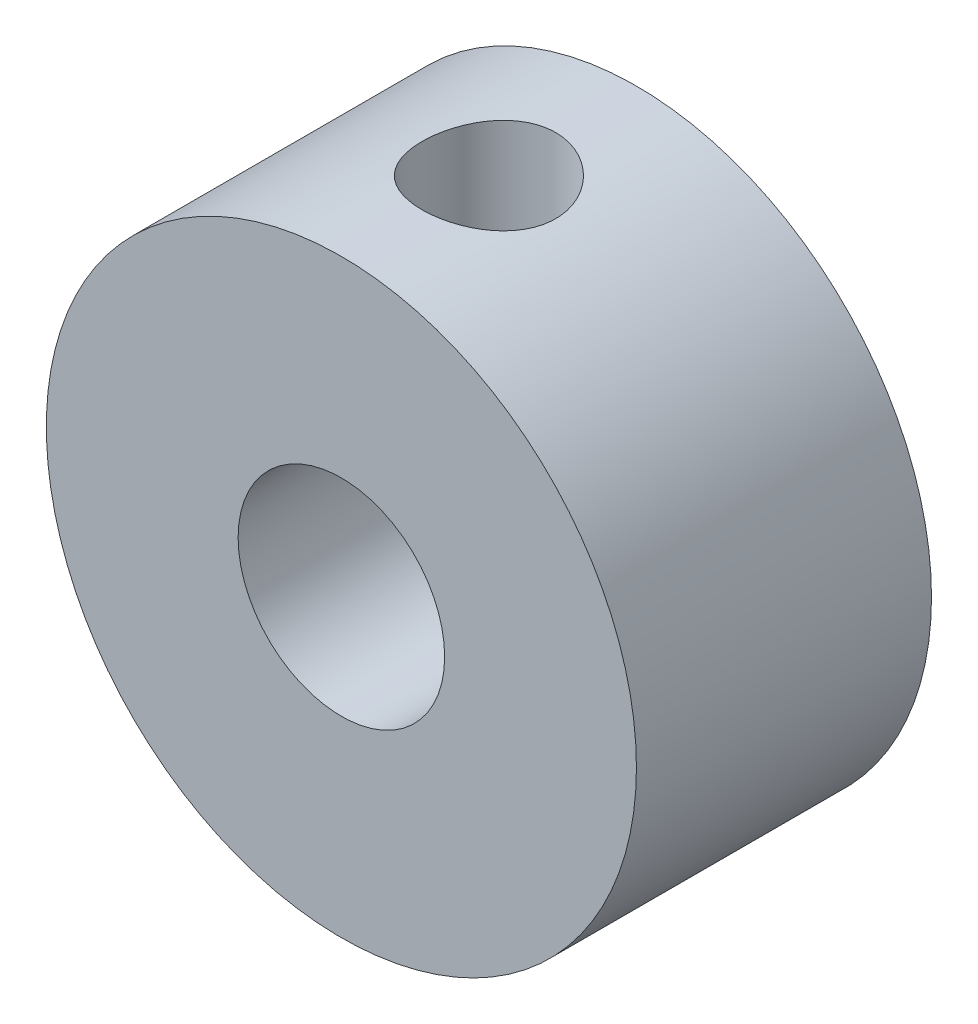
ISO-10303-21;
HEADER;
FILE_DESCRIPTION(('STEP AP214'),'2;1');
FILE_NAME('part.step','',(''),(''),'','','');
FILE_SCHEMA(('AUTOMOTIVE_DESIGN { 1 0 10303 214 1 1 1 1 }'));
ENDSEC;
DATA;
#1=APPLICATION_CONTEXT('core data for automotive mechanical design processes');
#2=APPLICATION_PROTOCOL_DEFINITION('international standard','automotive_design',2000,#1);
#3=PRODUCT_CONTEXT('',#1,'mechanical');
#4=PRODUCT('Part','Part','',(#3));
#5=PRODUCT_RELATED_PRODUCT_CATEGORY('part','',(#4));
#6=PRODUCT_DEFINITION_FORMATION('','',#4);
#7=PRODUCT_DEFINITION_CONTEXT('part definition',#1,'design');
#8=PRODUCT_DEFINITION('design','',#6,#7);
#9=PRODUCT_DEFINITION_SHAPE('','',#8);
#10=(LENGTH_UNIT() NAMED_UNIT(*) SI_UNIT(.MILLI.,.METRE.));
#11=(NAMED_UNIT(*) PLANE_ANGLE_UNIT() SI_UNIT($,.RADIAN.));
#12=(NAMED_UNIT(*) SI_UNIT($,.STERADIAN.) SOLID_ANGLE_UNIT());
#13=UNCERTAINTY_MEASURE_WITH_UNIT(LENGTH_MEASURE(1.E-05),#10,'distance_accuracy_value','');
#14=(GEOMETRIC_REPRESENTATION_CONTEXT(3) GLOBAL_UNCERTAINTY_ASSIGNED_CONTEXT((#13)) GLOBAL_UNIT_ASSIGNED_CONTEXT((#10,
#11,#12)) REPRESENTATION_CONTEXT('',''));
#15=CARTESIAN_POINT('',(0.,0.,0.));
#16=DIRECTION('',(0.,0.,1.));
#17=DIRECTION('',(1.,0.,0.));
#18=AXIS2_PLACEMENT_3D('',#15,#16,#17);
#19=CARTESIAN_POINT('',(0.,0.,7.49999999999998));
#20=DIRECTION('',(0.,0.,0.999999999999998));
#21=DIRECTION('',(1.,0.,0.));
#22=AXIS2_PLACEMENT_3D('',#19,#20,#21);
#23=PLANE('',#22);
#24=CARTESIAN_POINT('',(0.,0.,7.49999999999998));
#25=DIRECTION('',(0.,0.,0.999999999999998));
#26=DIRECTION('',(1.,0.,0.));
#27=AXIS2_PLACEMENT_3D('',#24,#25,#26);
#28=CIRCLE('',#27,15.);
#29=CARTESIAN_POINT('',(15.,0.,7.49999999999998));
#30=VERTEX_POINT('',#29);
#31=EDGE_CURVE('E13',#30,#30,#28,.T.);
#32=ORIENTED_EDGE('',*,*,#31,.T.);
#33=EDGE_LOOP('',(#32));
#34=FACE_BOUND('',#33,.T.);
#35=CARTESIAN_POINT('',(0.,0.,7.49999999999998));
#36=DIRECTION('',(0.,0.,0.999999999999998));
#37=DIRECTION('',(1.,0.,0.));
#38=AXIS2_PLACEMENT_3D('',#35,#36,#37);
#39=CIRCLE('',#38,5.25);
#40=CARTESIAN_POINT('',(5.25,0.,7.49999999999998));
#41=VERTEX_POINT('',#40);
#42=EDGE_CURVE('E78',#41,#41,#39,.T.);
#43=ORIENTED_EDGE('',*,*,#42,.F.);
#44=EDGE_LOOP('',(#43));
#45=FACE_BOUND('',#44,.T.);
#46=ADVANCED_FACE('F48',(#34,#45),#23,.T.);
#47=CARTESIAN_POINT('',(0.,0.,-7.49999999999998));
#48=DIRECTION('',(0.,0.,0.999999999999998));
#49=DIRECTION('',(1.,0.,0.));
#50=AXIS2_PLACEMENT_3D('',#47,#48,#49);
#51=PLANE('',#50);
#52=CARTESIAN_POINT('',(0.,0.,-7.49999999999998));
#53=DIRECTION('',(0.,0.,0.999999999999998));
#54=DIRECTION('',(1.,0.,0.));
#55=AXIS2_PLACEMENT_3D('',#52,#53,#54);
#56=CIRCLE('',#55,15.);
#57=CARTESIAN_POINT('',(15.,0.,-7.49999999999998));
#58=VERTEX_POINT('',#57);
#59=EDGE_CURVE('E62',#58,#58,#56,.T.);
#60=ORIENTED_EDGE('',*,*,#59,.F.);
#61=EDGE_LOOP('',(#60));
#62=FACE_BOUND('',#61,.T.);
#63=CARTESIAN_POINT('',(0.,0.,-7.49999999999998));
#64=DIRECTION('',(0.,0.,0.999999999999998));
#65=DIRECTION('',(1.,0.,0.));
#66=AXIS2_PLACEMENT_3D('',#63,#64,#65);
#67=CIRCLE('',#66,5.25);
#68=CARTESIAN_POINT('',(5.25,0.,-7.49999999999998));
#69=VERTEX_POINT('',#68);
#70=EDGE_CURVE('E76',#69,#69,#67,.T.);
#71=ORIENTED_EDGE('',*,*,#70,.T.);
#72=EDGE_LOOP('',(#71));
#73=FACE_BOUND('',#72,.T.);
#74=ADVANCED_FACE('F93',(#62,#73),#51,.F.);
#75=CARTESIAN_POINT('',(0.,0.,7.49999999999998));
#76=DIRECTION('',(0.,0.,-0.999999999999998));
#77=DIRECTION('',(-1.,0.,0.));
#78=AXIS2_PLACEMENT_3D('',#75,#76,#77);
#79=CYLINDRICAL_SURFACE('',#78,15.);
#80=CARTESIAN_POINT('',(0.,15.,3.39999999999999));
#81=CARTESIAN_POINT('',(-0.188398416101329,14.9999965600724,3.39999381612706));
#82=CARTESIAN_POINT('',(-0.37687010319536,14.9964147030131,3.38428806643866));
#83=CARTESIAN_POINT('',(-0.748448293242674,14.9824721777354,3.32195220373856));
#84=CARTESIAN_POINT('',(-0.931551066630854,14.9721069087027,3.27530110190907));
#85=CARTESIAN_POINT('',(-1.28696868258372,14.9457501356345,3.1526200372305));
#86=CARTESIAN_POINT('',(-1.45929497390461,14.9297647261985,3.07662189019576));
#87=CARTESIAN_POINT('',(-1.78874674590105,14.8938873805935,2.8975077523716));
#88=CARTESIAN_POINT('',(-1.94587239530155,14.8739954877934,2.79439206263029));
#89=CARTESIAN_POINT('',(-2.24316295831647,14.8320979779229,2.5620984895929));
#90=CARTESIAN_POINT('',(-2.38302976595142,14.8100645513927,2.43254407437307));
#91=CARTESIAN_POINT('',(-2.6392459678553,14.7665604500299,2.1518584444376));
#92=CARTESIAN_POINT('',(-2.75559313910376,14.745089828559,2.00072519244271));
#93=CARTESIAN_POINT('',(-2.96280355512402,14.7048667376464,1.67894112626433));
#94=CARTESIAN_POINT('',(-3.05334554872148,14.6861498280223,1.50807860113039));
#95=CARTESIAN_POINT('',(-3.2043135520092,14.6539541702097,1.15306825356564));
#96=CARTESIAN_POINT('',(-3.26474345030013,14.6404747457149,0.968922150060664));
#97=CARTESIAN_POINT('',(-3.35277893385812,14.6205641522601,0.595816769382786));
#98=CARTESIAN_POINT('',(-3.38091436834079,14.6140193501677,0.406988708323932));
#99=CARTESIAN_POINT('',(-3.40521049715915,14.6083780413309,0.0271878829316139));
#100=CARTESIAN_POINT('',(-3.40137542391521,14.6092805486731,-0.163784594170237));
#101=CARTESIAN_POINT('',(-3.36226490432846,14.6183291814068,-0.538485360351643));
#102=CARTESIAN_POINT('',(-3.32760872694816,14.6263326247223,-0.722282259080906));
#103=CARTESIAN_POINT('',(-3.22882250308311,14.6484553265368,-1.08138332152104));
#104=CARTESIAN_POINT('',(-3.16469069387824,14.6625749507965,-1.25668697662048));
#105=CARTESIAN_POINT('',(-3.00821508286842,14.6954773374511,-1.59554668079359));
#106=CARTESIAN_POINT('',(-2.9156364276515,14.7142986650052,-1.75899038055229));
#107=CARTESIAN_POINT('',(-2.70505999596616,14.7544605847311,-2.06825036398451));
#108=CARTESIAN_POINT('',(-2.58705851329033,14.7758015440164,-2.21406407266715));
#109=CARTESIAN_POINT('',(-2.32572493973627,14.819207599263,-2.48748645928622));
#110=CARTESIAN_POINT('',(-2.1818671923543,14.8412779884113,-2.61459241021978));
#111=CARTESIAN_POINT('',(-1.87462374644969,14.883204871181,-2.84296027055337));
#112=CARTESIAN_POINT('',(-1.71123764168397,14.9030613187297,-2.94422164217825));
#113=CARTESIAN_POINT('',(-1.36893681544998,14.938395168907,-3.11816447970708));
#114=CARTESIAN_POINT('',(-1.18998551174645,14.9538618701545,-3.19077626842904));
#115=CARTESIAN_POINT('',(-0.821991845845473,14.9785945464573,-3.30475659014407));
#116=CARTESIAN_POINT('',(-0.632951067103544,14.9878614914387,-3.34613001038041));
#117=CARTESIAN_POINT('',(-0.254453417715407,14.9990111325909,-3.39571913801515));
#118=CARTESIAN_POINT('',(-0.0650908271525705,15.0010466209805,-3.40462104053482));
#119=CARTESIAN_POINT('',(0.312416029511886,14.9979338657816,-3.3908796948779));
#120=CARTESIAN_POINT('',(0.500560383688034,14.9927861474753,-3.36823875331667));
#121=CARTESIAN_POINT('',(0.867989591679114,14.9759821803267,-3.29262273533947));
#122=CARTESIAN_POINT('',(1.04735312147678,14.9644039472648,-3.24001107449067));
#123=CARTESIAN_POINT('',(1.39470739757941,14.9360365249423,-3.10635327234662));
#124=CARTESIAN_POINT('',(1.56269712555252,14.9192468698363,-3.02530458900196));
#125=CARTESIAN_POINT('',(1.88534686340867,14.8819443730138,-2.83566807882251));
#126=CARTESIAN_POINT('',(2.03976639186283,14.8613789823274,-2.72668166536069));
#127=CARTESIAN_POINT('',(2.32837060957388,14.818907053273,-2.48478445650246));
#128=CARTESIAN_POINT('',(2.46255245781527,14.7970003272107,-2.35187030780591));
#129=CARTESIAN_POINT('',(2.7096136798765,14.7537814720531,-2.06273173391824));
#130=CARTESIAN_POINT('',(2.82201624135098,14.7324898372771,-1.90609623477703));
#131=CARTESIAN_POINT('',(3.0189258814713,14.6934068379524,-1.57577037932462));
#132=CARTESIAN_POINT('',(3.10343419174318,14.6756153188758,-1.40208077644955));
#133=CARTESIAN_POINT('',(3.24156644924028,14.645724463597,-1.04352103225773));
#134=CARTESIAN_POINT('',(3.29536818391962,14.6335924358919,-0.858722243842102));
#135=CARTESIAN_POINT('',(3.37107068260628,14.6163407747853,-0.4823940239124));
#136=CARTESIAN_POINT('',(3.39297698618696,14.6112199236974,-0.290865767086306));
#137=CARTESIAN_POINT('',(3.40401761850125,14.6086511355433,0.0886670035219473));
#138=CARTESIAN_POINT('',(3.39390928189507,14.6110258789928,0.276648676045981));
#139=CARTESIAN_POINT('',(3.34291038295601,14.6227775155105,0.648154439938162));
#140=CARTESIAN_POINT('',(3.30202024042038,14.632154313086,0.83167859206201));
#141=CARTESIAN_POINT('',(3.19099639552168,14.656763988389,1.18840444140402));
#142=CARTESIAN_POINT('',(3.12098065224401,14.6719732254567,1.36164459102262));
#143=CARTESIAN_POINT('',(2.95379168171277,14.706541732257,1.69402899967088));
#144=CARTESIAN_POINT('',(2.85661538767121,14.7259014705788,1.85317166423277));
#145=CARTESIAN_POINT('',(2.63538535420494,14.7671135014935,2.1565594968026));
#146=CARTESIAN_POINT('',(2.51079524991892,14.7890106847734,2.30040752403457));
#147=CARTESIAN_POINT('',(2.23935138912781,14.8325373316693,2.56540247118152));
#148=CARTESIAN_POINT('',(2.09249246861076,14.8541667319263,2.68654411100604));
#149=CARTESIAN_POINT('',(1.77817220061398,14.895084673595,2.90433795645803));
#150=CARTESIAN_POINT('',(1.61044858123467,14.9143357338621,3.00061912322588));
#151=CARTESIAN_POINT('',(1.26079154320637,14.947947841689,3.16346882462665));
#152=CARTESIAN_POINT('',(1.07886977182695,14.9623128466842,3.23006141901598));
#153=CARTESIAN_POINT('',(0.747399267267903,14.9820757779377,3.32024767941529));
#154=CARTESIAN_POINT('',(0.599596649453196,14.988754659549,3.35009597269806));
#155=CARTESIAN_POINT('',(0.301211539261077,14.9977180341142,3.38997410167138));
#156=CARTESIAN_POINT('',(0.150629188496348,15.0000027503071,3.40000494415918));
#157=CARTESIAN_POINT('',(0.,15.,3.39999999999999));
#158=B_SPLINE_CURVE_WITH_KNOTS('',3,(#80,#81,#82,#83,#84,#85,#86,#87,#88,#89,#90,#91,#92,#93,
#94,#95,#96,#97,#98,#99,#100,#101,#102,#103,#104,#105,#106,#107,#108,#109,#110,#111,#112,#113,
#114,#115,#116,#117,#118,#119,#120,#121,#122,#123,#124,#125,#126,#127,#128,#129,#130,#131,#132,
#133,#134,#135,#136,#137,#138,#139,#140,#141,#142,#143,#144,#145,#146,#147,#148,#149,#150,#151,
#152,#153,#154,#155,#156,#157),.UNSPECIFIED.,.T.,.F.,(4,2,2,2,2,2,2,2,2,2,2,2,2,2,2,2,2,2,2,2,2,
2,2,2,2,2,2,2,2,2,2,2,2,2,2,2,2,2,4),(0.,0.564643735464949,1.12967083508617,1.69408708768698,
2.25849707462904,2.83158982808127,3.40473672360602,3.98473482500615,4.56465800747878,
5.13492402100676,5.70511454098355,6.26410109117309,6.82312107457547,7.38688623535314,
7.95073363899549,8.52770490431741,9.10468817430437,9.68306617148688,10.2613536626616,
10.8273474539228,11.3932998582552,11.952531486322,12.5118131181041,13.0795672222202,
13.6474009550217,14.2265293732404,14.8056322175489,15.3813471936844,15.9569621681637,
16.5190630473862,17.0811562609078,17.640994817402,18.2008966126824,18.7729206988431,
19.3450776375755,19.925335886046,20.5051230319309,20.9565925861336,21.4080392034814),.UNSPECIFIED.);
#159=CARTESIAN_POINT('',(0.,15.,-3.39999999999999));
#160=VERTEX_POINT('',#159);
#161=CARTESIAN_POINT('',(0.,15.,3.39999999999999));
#162=VERTEX_POINT('',#161);
#163=EDGE_CURVE('E71',#160,#162,#158,.T.);
#164=ORIENTED_EDGE('',*,*,#163,.T.);
#165=EDGE_CURVE('E69',#162,#160,#158,.T.);
#166=ORIENTED_EDGE('',*,*,#165,.T.);
#167=EDGE_LOOP('',(#164,#166));
#168=FACE_BOUND('',#167,.T.);
#169=ORIENTED_EDGE('',*,*,#31,.F.);
#170=EDGE_LOOP('',(#169));
#171=FACE_BOUND('',#170,.T.);
#172=ORIENTED_EDGE('',*,*,#59,.T.);
#173=EDGE_LOOP('',(#172));
#174=FACE_BOUND('',#173,.T.);
#175=ADVANCED_FACE('F50',(#168,#171,#174),#79,.T.);
#176=CARTESIAN_POINT('',(0.,0.,7.49999999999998));
#177=DIRECTION('',(0.,0.,-0.999999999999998));
#178=DIRECTION('',(-1.,0.,0.));
#179=AXIS2_PLACEMENT_3D('',#176,#177,#178);
#180=CYLINDRICAL_SURFACE('',#179,5.25);
#181=CARTESIAN_POINT('',(0.,5.25,3.39999999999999));
#182=CARTESIAN_POINT('',(-0.17173476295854,5.24999124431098,3.39999065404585));
#183=CARTESIAN_POINT('',(-0.343554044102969,5.24149334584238,3.38690945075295));
#184=CARTESIAN_POINT('',(-0.681779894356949,5.20832437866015,3.33534392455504));
#185=CARTESIAN_POINT('',(-0.848181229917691,5.18363813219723,3.29683576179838));
#186=CARTESIAN_POINT('',(-1.17014669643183,5.12055289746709,3.196726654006));
#187=CARTESIAN_POINT('',(-1.32575807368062,5.08221888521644,3.13523506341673));
#188=CARTESIAN_POINT('',(-1.6238760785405,4.9949661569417,2.99172653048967));
#189=CARTESIAN_POINT('',(-1.76638169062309,4.94604662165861,2.90970799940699));
#190=CARTESIAN_POINT('',(-2.04754167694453,4.8368021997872,2.72004971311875));
#191=CARTESIAN_POINT('',(-2.18490416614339,4.77586881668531,2.61085258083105));
#192=CARTESIAN_POINT('',(-2.44060428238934,4.65040678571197,2.37359038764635));
#193=CARTESIAN_POINT('',(-2.55891504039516,4.58587323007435,2.24549915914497));
#194=CARTESIAN_POINT('',(-2.79095516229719,4.44901572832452,1.9520666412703));
#195=CARTESIAN_POINT('',(-2.90143720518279,4.37694601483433,1.78401772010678));
#196=CARTESIAN_POINT('',(-3.09236178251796,4.24421246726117,1.42758222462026));
#197=CARTESIAN_POINT('',(-3.17285609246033,4.18352906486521,1.23923143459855));
#198=CARTESIAN_POINT('',(-3.28213351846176,4.09799109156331,0.900009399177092));
#199=CARTESIAN_POINT('',(-3.31905235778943,4.06787194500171,0.753097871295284));
#200=CARTESIAN_POINT('',(-3.3730498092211,4.02321997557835,0.453454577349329));
#201=CARTESIAN_POINT('',(-3.39015969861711,4.00866258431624,0.300732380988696));
#202=CARTESIAN_POINT('',(-3.40348573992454,3.99735901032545,-0.00682447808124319));
#203=CARTESIAN_POINT('',(-3.39963182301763,4.00067255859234,-0.161664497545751));
#204=CARTESIAN_POINT('',(-3.37114402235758,4.02469935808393,-0.468093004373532));
#205=CARTESIAN_POINT('',(-3.34649280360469,4.04542712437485,-0.619678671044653));
#206=CARTESIAN_POINT('',(-3.2790934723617,4.10022273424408,-0.910559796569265));
#207=CARTESIAN_POINT('',(-3.23698152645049,4.13381874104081,-1.05009710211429));
#208=CARTESIAN_POINT('',(-3.13648726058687,4.2105743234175,-1.32032388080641));
#209=CARTESIAN_POINT('',(-3.07809957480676,4.25373705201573,-1.4510104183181));
#210=CARTESIAN_POINT('',(-2.9335611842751,4.35498968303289,-1.72715181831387));
#211=CARTESIAN_POINT('',(-2.84420972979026,4.41434625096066,-1.87046410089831));
#212=CARTESIAN_POINT('',(-2.64600929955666,4.53593279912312,-2.14170427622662));
#213=CARTESIAN_POINT('',(-2.53713687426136,4.59816616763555,-2.26961335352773));
#214=CARTESIAN_POINT('',(-2.27853834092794,4.73242403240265,-2.5314597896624));
#215=CARTESIAN_POINT('',(-2.1249812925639,4.80404224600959,-2.66186376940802));
#216=CARTESIAN_POINT('',(-1.79428434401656,4.93707458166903,-2.89505598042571));
#217=CARTESIAN_POINT('',(-1.61716919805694,4.99849926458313,-2.99787286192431));
#218=CARTESIAN_POINT('',(-1.28023250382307,5.09390039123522,-3.15409665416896));
#219=CARTESIAN_POINT('',(-1.12393712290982,5.13090388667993,-3.21325700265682));
#220=CARTESIAN_POINT('',(-0.801890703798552,5.1909751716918,-3.30833691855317));
#221=CARTESIAN_POINT('',(-0.63614751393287,5.21405434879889,-3.34427547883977));
#222=CARTESIAN_POINT('',(-0.299068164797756,5.24421376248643,-3.39110661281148));
#223=CARTESIAN_POINT('',(-0.127714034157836,5.25123615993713,-3.40190864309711));
#224=CARTESIAN_POINT('',(0.214530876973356,5.24840492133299,-3.39753713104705));
#225=CARTESIAN_POINT('',(0.385421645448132,5.2385508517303,-3.382362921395));
#226=CARTESIAN_POINT('',(0.71156042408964,5.20399289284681,-3.3285776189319));
#227=CARTESIAN_POINT('',(0.867141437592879,5.18018113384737,-3.29137327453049));
#228=CARTESIAN_POINT('',(1.1694171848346,5.1204221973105,-3.19649455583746));
#229=CARTESIAN_POINT('',(1.3161104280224,5.08447299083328,-3.13881675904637));
#230=CARTESIAN_POINT('',(1.60794971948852,5.00016785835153,-3.00040109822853));
#231=CARTESIAN_POINT('',(1.75225275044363,4.95111434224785,-2.91832093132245));
#232=CARTESIAN_POINT('',(2.02567374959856,4.84568469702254,-2.73563975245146));
#233=CARTESIAN_POINT('',(2.15478050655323,4.78930322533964,-2.63502520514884));
#234=CARTESIAN_POINT('',(2.41517391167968,4.66405281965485,-2.40046437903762));
#235=CARTESIAN_POINT('',(2.54370787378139,4.59460141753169,-2.26376959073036));
#236=CARTESIAN_POINT('',(2.77706172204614,4.45743762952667,-1.97054392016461));
#237=CARTESIAN_POINT('',(2.88187395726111,4.38972581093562,-1.81400666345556));
#238=CARTESIAN_POINT('',(3.05406851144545,4.27138117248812,-1.50339181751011));
#239=CARTESIAN_POINT('',(3.12447798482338,4.21967176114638,-1.35140802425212));
#240=CARTESIAN_POINT('',(3.24294694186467,4.12933414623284,-1.03520048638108));
#241=CARTESIAN_POINT('',(3.29103627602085,4.09068849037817,-0.870993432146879));
#242=CARTESIAN_POINT('',(3.3446022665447,4.04680833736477,-0.617451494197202));
#243=CARTESIAN_POINT('',(3.35939343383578,4.03450026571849,-0.531213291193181));
#244=CARTESIAN_POINT('',(3.38231139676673,4.01530817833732,-0.357277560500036));
#245=CARTESIAN_POINT('',(3.39044182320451,4.00842120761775,-0.269580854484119));
#246=CARTESIAN_POINT('',(3.39985252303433,4.00044279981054,-0.0936032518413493));
#247=CARTESIAN_POINT('',(3.40113666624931,3.9993480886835,-0.00532271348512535));
#248=CARTESIAN_POINT('',(3.39684663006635,4.00299051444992,0.170921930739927));
#249=CARTESIAN_POINT('',(3.39127312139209,4.00772708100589,0.258886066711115));
#250=CARTESIAN_POINT('',(3.36723688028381,4.0279834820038,0.493516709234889));
#251=CARTESIAN_POINT('',(3.34256381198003,4.04866443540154,0.639161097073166));
#252=CARTESIAN_POINT('',(3.27541107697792,4.10317022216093,0.923659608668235));
#253=CARTESIAN_POINT('',(3.23291303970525,4.13700861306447,1.06250656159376));
#254=CARTESIAN_POINT('',(3.11439492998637,4.22732890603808,1.37759760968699));
#255=CARTESIAN_POINT('',(3.03187507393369,4.28759626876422,1.55031274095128));
#256=CARTESIAN_POINT('',(2.8409807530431,4.41640076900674,1.87745107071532));
#257=CARTESIAN_POINT('',(2.73256653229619,4.4849505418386,2.03184559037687));
#258=CARTESIAN_POINT('',(2.49044223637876,4.62384649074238,2.32248389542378));
#259=CARTESIAN_POINT('',(2.35640858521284,4.69420442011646,2.45845266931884));
#260=CARTESIAN_POINT('',(2.06584520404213,4.82911808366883,2.70717135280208));
#261=CARTESIAN_POINT('',(1.90933634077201,4.89367911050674,2.81994256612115));
#262=CARTESIAN_POINT('',(1.59629842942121,5.00384451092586,3.00681253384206));
#263=CARTESIAN_POINT('',(1.44205684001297,5.05079683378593,3.08393763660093));
#264=CARTESIAN_POINT('',(1.12076728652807,5.13163572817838,3.2146282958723));
#265=CARTESIAN_POINT('',(0.953738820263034,5.16554173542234,3.26822891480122));
#266=CARTESIAN_POINT('',(0.655271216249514,5.21053853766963,3.33882178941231));
#267=CARTESIAN_POINT('',(0.525742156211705,5.22525599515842,3.36168651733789));
#268=CARTESIAN_POINT('',(0.264158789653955,5.24499025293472,3.39227946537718));
#269=CARTESIAN_POINT('',(0.132104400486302,5.25000673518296,3.40000718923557));
#270=CARTESIAN_POINT('',(0.,5.25,3.39999999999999));
#271=B_SPLINE_CURVE_WITH_KNOTS('',3,(#181,#182,#183,#184,#185,#186,#187,#188,#189,#190,#191,
#192,#193,#194,#195,#196,#197,#198,#199,#200,#201,#202,#203,#204,#205,#206,#207,#208,#209,#210,
#211,#212,#213,#214,#215,#216,#217,#218,#219,#220,#221,#222,#223,#224,#225,#226,#227,#228,#229,
#230,#231,#232,#233,#234,#235,#236,#237,#238,#239,#240,#241,#242,#243,#244,#245,#246,#247,#248,
#249,#250,#251,#252,#253,#254,#255,#256,#257,#258,#259,#260,#261,#262,#263,#264,#265,#266,#267,
#268,#269,#270),.UNSPECIFIED.,.T.,.F.,(4,2,2,2,2,2,2,2,2,2,2,2,2,2,2,2,2,2,2,2,2,2,2,2,2,2,2,2,
2,2,2,2,2,2,2,2,2,2,2,2,2,2,2,2,4),(0.,0.51467021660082,1.02982366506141,1.54255660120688,
2.05532923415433,2.61048479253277,3.16641656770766,3.80431401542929,4.44110493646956,
4.90256123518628,5.3632879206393,5.82555546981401,6.2882087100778,6.73531022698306,
7.18255932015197,7.71767396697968,8.25343577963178,8.89175957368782,9.5294178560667,
10.0407392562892,10.5516419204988,11.0643820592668,11.5771353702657,12.0602230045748,
12.5433914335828,13.0607282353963,13.5784443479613,14.1762527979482,14.7742537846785,
15.2982363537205,15.821516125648,16.0862292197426,16.3507979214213,16.6152170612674,
16.879610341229,17.3249343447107,17.7707184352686,18.3695679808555,18.9693429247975,
19.5772641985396,20.1846246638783,20.7185976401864,21.2517720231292,21.6476614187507,
22.0435637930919),.UNSPECIFIED.);
#272=CARTESIAN_POINT('',(0.,5.25,3.39999999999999));
#273=VERTEX_POINT('',#272);
#274=EDGE_CURVE('E53',#273,#273,#271,.T.);
#275=ORIENTED_EDGE('',*,*,#274,.F.);
#276=EDGE_LOOP('',(#275));
#277=FACE_BOUND('',#276,.T.);
#278=ORIENTED_EDGE('',*,*,#42,.T.);
#279=EDGE_LOOP('',(#278));
#280=FACE_BOUND('',#279,.T.);
#281=ORIENTED_EDGE('',*,*,#70,.F.);
#282=EDGE_LOOP('',(#281));
#283=FACE_BOUND('',#282,.T.);
#284=ADVANCED_FACE('F85',(#277,#280,#283),#180,.F.);
#285=CARTESIAN_POINT('',(0.,15.,0.));
#286=DIRECTION('',(0.,1.,0.));
#287=DIRECTION('',(0.,0.,0.999999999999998));
#288=AXIS2_PLACEMENT_3D('',#285,#286,#287);
#289=CYLINDRICAL_SURFACE('',#288,3.39999999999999);
#290=ORIENTED_EDGE('',*,*,#274,.T.);
#291=EDGE_LOOP('',(#290));
#292=FACE_BOUND('',#291,.T.);
#293=ORIENTED_EDGE('',*,*,#163,.F.);
#294=ORIENTED_EDGE('',*,*,#165,.F.);
#295=EDGE_LOOP('',(#293,#294));
#296=FACE_BOUND('',#295,.T.);
#297=ADVANCED_FACE('F72',(#292,#296),#289,.F.);
#298=CLOSED_SHELL('',(#46,#74,#175,#284,#297));
#299=MANIFOLD_SOLID_BREP('B2',#298);
#300=ADVANCED_BREP_SHAPE_REPRESENTATION('',(#18,#299),#14);
#301=SHAPE_DEFINITION_REPRESENTATION(#9,#300);
ENDSEC;
END-ISO-10303-21;
